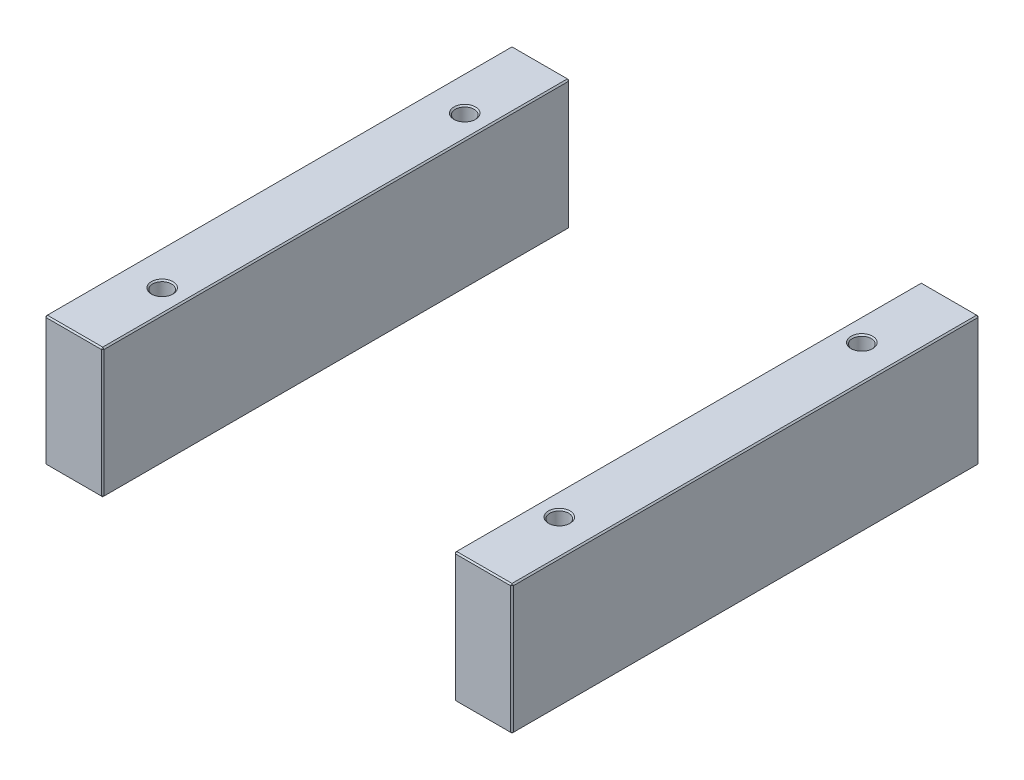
ISO-10303-21;
HEADER;
FILE_DESCRIPTION(('STEP AP214'),'2;1');
FILE_NAME('part.step','',(''),(''),'','','');
FILE_SCHEMA(('AUTOMOTIVE_DESIGN { 1 0 10303 214 1 1 1 1 }'));
ENDSEC;
DATA;
#1=APPLICATION_CONTEXT('core data for automotive mechanical design processes');
#2=APPLICATION_PROTOCOL_DEFINITION('international standard','automotive_design',2000,#1);
#3=PRODUCT_CONTEXT('',#1,'mechanical');
#4=PRODUCT('Part','Part','',(#3));
#5=PRODUCT_RELATED_PRODUCT_CATEGORY('part','',(#4));
#6=PRODUCT_DEFINITION_FORMATION('','',#4);
#7=PRODUCT_DEFINITION_CONTEXT('part definition',#1,'design');
#8=PRODUCT_DEFINITION('design','',#6,#7);
#9=PRODUCT_DEFINITION_SHAPE('','',#8);
#10=(LENGTH_UNIT() NAMED_UNIT(*) SI_UNIT(.MILLI.,.METRE.));
#11=(NAMED_UNIT(*) PLANE_ANGLE_UNIT() SI_UNIT($,.RADIAN.));
#12=(NAMED_UNIT(*) SI_UNIT($,.STERADIAN.) SOLID_ANGLE_UNIT());
#13=UNCERTAINTY_MEASURE_WITH_UNIT(LENGTH_MEASURE(1.E-05),#10,'distance_accuracy_value','');
#14=(GEOMETRIC_REPRESENTATION_CONTEXT(3) GLOBAL_UNCERTAINTY_ASSIGNED_CONTEXT((#13)) GLOBAL_UNIT_ASSIGNED_CONTEXT((#10,
#11,#12)) REPRESENTATION_CONTEXT('',''));
#15=CARTESIAN_POINT('',(0.,0.,0.));
#16=DIRECTION('',(0.,0.,1.));
#17=DIRECTION('',(1.,0.,0.));
#18=AXIS2_PLACEMENT_3D('',#15,#16,#17);
#19=CARTESIAN_POINT('',(-173.,96.,-173.));
#20=DIRECTION('',(0.,0.,1.));
#21=DIRECTION('',(1.,0.,0.));
#22=AXIS2_PLACEMENT_3D('',#19,#20,#21);
#23=PLANE('',#22);
#24=DIRECTION('',(-1.,0.,0.));
#25=VECTOR('',#24,1.);
#26=CARTESIAN_POINT('',(-173.,1.,-173.));
#27=LINE('',#26,#25);
#28=CARTESIAN_POINT('',(-131.,1.,-173.));
#29=VERTEX_POINT('',#28);
#30=CARTESIAN_POINT('',(-172.,1.,-173.));
#31=VERTEX_POINT('',#30);
#32=EDGE_CURVE('P0_E137',#29,#31,#27,.T.);
#33=ORIENTED_EDGE('',*,*,#32,.T.);
#34=DIRECTION('',(0.,1.,0.));
#35=VECTOR('',#34,1.);
#36=CARTESIAN_POINT('',(-172.,96.,-173.));
#37=LINE('',#36,#35);
#38=CARTESIAN_POINT('',(-172.,95.,-173.));
#39=VERTEX_POINT('',#38);
#40=EDGE_CURVE('P0_E235',#31,#39,#37,.T.);
#41=ORIENTED_EDGE('',*,*,#40,.T.);
#42=DIRECTION('',(1.,0.,0.));
#43=VECTOR('',#42,1.);
#44=CARTESIAN_POINT('',(-173.,95.,-173.));
#45=LINE('',#44,#43);
#46=CARTESIAN_POINT('',(-131.,95.,-173.));
#47=VERTEX_POINT('',#46);
#48=EDGE_CURVE('P0_E233',#39,#47,#45,.T.);
#49=ORIENTED_EDGE('',*,*,#48,.T.);
#50=DIRECTION('',(0.,-1.,0.));
#51=VECTOR('',#50,1.);
#52=CARTESIAN_POINT('',(-131.,96.,-173.));
#53=LINE('',#52,#51);
#54=EDGE_CURVE('P0_E230',#47,#29,#53,.T.);
#55=ORIENTED_EDGE('',*,*,#54,.T.);
#56=EDGE_LOOP('',(#33,#41,#49,#55));
#57=FACE_BOUND('',#56,.T.);
#58=ADVANCED_FACE('P0_F16',(#57),#23,.F.);
#59=CARTESIAN_POINT('',(-173.,96.,173.));
#60=DIRECTION('',(1.,0.,0.));
#61=DIRECTION('',(0.,0.,-1.));
#62=AXIS2_PLACEMENT_3D('',#59,#60,#61);
#63=PLANE('',#62);
#64=DIRECTION('',(0.,1.,0.));
#65=VECTOR('',#64,1.);
#66=CARTESIAN_POINT('',(-173.,96.,172.));
#67=LINE('',#66,#65);
#68=CARTESIAN_POINT('',(-173.,1.,172.));
#69=VERTEX_POINT('',#68);
#70=CARTESIAN_POINT('',(-173.,95.,172.));
#71=VERTEX_POINT('',#70);
#72=EDGE_CURVE('P0_E217',#69,#71,#67,.T.);
#73=ORIENTED_EDGE('',*,*,#72,.T.);
#74=DIRECTION('',(0.,0.,-1.));
#75=VECTOR('',#74,1.);
#76=CARTESIAN_POINT('',(-173.,95.,173.));
#77=LINE('',#76,#75);
#78=CARTESIAN_POINT('',(-173.,95.,-172.));
#79=VERTEX_POINT('',#78);
#80=EDGE_CURVE('P0_E228',#71,#79,#77,.T.);
#81=ORIENTED_EDGE('',*,*,#80,.T.);
#82=DIRECTION('',(0.,-1.,0.));
#83=VECTOR('',#82,1.);
#84=CARTESIAN_POINT('',(-173.,96.,-172.));
#85=LINE('',#84,#83);
#86=CARTESIAN_POINT('',(-173.,1.,-172.));
#87=VERTEX_POINT('',#86);
#88=EDGE_CURVE('P0_E225',#79,#87,#85,.T.);
#89=ORIENTED_EDGE('',*,*,#88,.T.);
#90=DIRECTION('',(0.,0.,1.));
#91=VECTOR('',#90,1.);
#92=CARTESIAN_POINT('',(-173.,1.,173.));
#93=LINE('',#92,#91);
#94=EDGE_CURVE('P0_E214',#87,#69,#93,.T.);
#95=ORIENTED_EDGE('',*,*,#94,.T.);
#96=EDGE_LOOP('',(#73,#81,#89,#95));
#97=FACE_BOUND('',#96,.T.);
#98=ADVANCED_FACE('P0_F302',(#97),#63,.F.);
#99=CARTESIAN_POINT('',(-173.,96.,173.));
#100=DIRECTION('',(0.,0.,-1.));
#101=DIRECTION('',(-1.,0.,0.));
#102=AXIS2_PLACEMENT_3D('',#99,#100,#101);
#103=PLANE('',#102);
#104=DIRECTION('',(-1.,0.,0.));
#105=VECTOR('',#104,1.);
#106=CARTESIAN_POINT('',(-173.,95.,173.));
#107=LINE('',#106,#105);
#108=CARTESIAN_POINT('',(-131.,95.,173.));
#109=VERTEX_POINT('',#108);
#110=CARTESIAN_POINT('',(-172.,95.,173.));
#111=VERTEX_POINT('',#110);
#112=EDGE_CURVE('P0_E242',#109,#111,#107,.T.);
#113=ORIENTED_EDGE('',*,*,#112,.T.);
#114=DIRECTION('',(0.,-1.,0.));
#115=VECTOR('',#114,1.);
#116=CARTESIAN_POINT('',(-172.,96.,173.));
#117=LINE('',#116,#115);
#118=CARTESIAN_POINT('',(-172.,1.,173.));
#119=VERTEX_POINT('',#118);
#120=EDGE_CURVE('P0_E244',#111,#119,#117,.T.);
#121=ORIENTED_EDGE('',*,*,#120,.T.);
#122=DIRECTION('',(1.,0.,0.));
#123=VECTOR('',#122,1.);
#124=CARTESIAN_POINT('',(-130.,1.,173.));
#125=LINE('',#124,#123);
#126=CARTESIAN_POINT('',(-131.,1.,173.));
#127=VERTEX_POINT('',#126);
#128=EDGE_CURVE('P0_E240',#119,#127,#125,.T.);
#129=ORIENTED_EDGE('',*,*,#128,.T.);
#130=DIRECTION('',(0.,1.,0.));
#131=VECTOR('',#130,1.);
#132=CARTESIAN_POINT('',(-131.,96.,173.));
#133=LINE('',#132,#131);
#134=EDGE_CURVE('P0_E238',#127,#109,#133,.T.);
#135=ORIENTED_EDGE('',*,*,#134,.T.);
#136=EDGE_LOOP('',(#113,#121,#129,#135));
#137=FACE_BOUND('',#136,.T.);
#138=ADVANCED_FACE('P0_F341',(#137),#103,.F.);
#139=CARTESIAN_POINT('',(-130.,96.,-173.));
#140=DIRECTION('',(-1.,0.,0.));
#141=DIRECTION('',(0.,0.,1.));
#142=AXIS2_PLACEMENT_3D('',#139,#140,#141);
#143=PLANE('',#142);
#144=DIRECTION('',(0.,0.,1.));
#145=VECTOR('',#144,1.);
#146=CARTESIAN_POINT('',(-130.,95.,-173.));
#147=LINE('',#146,#145);
#148=CARTESIAN_POINT('',(-130.,95.,-172.));
#149=VERTEX_POINT('',#148);
#150=CARTESIAN_POINT('',(-130.,95.,172.));
#151=VERTEX_POINT('',#150);
#152=EDGE_CURVE('P0_E31',#149,#151,#147,.T.);
#153=ORIENTED_EDGE('',*,*,#152,.T.);
#154=DIRECTION('',(0.,-1.,0.));
#155=VECTOR('',#154,1.);
#156=CARTESIAN_POINT('',(-130.,96.,172.));
#157=LINE('',#156,#155);
#158=CARTESIAN_POINT('',(-130.,1.,172.));
#159=VERTEX_POINT('',#158);
#160=EDGE_CURVE('P0_E190',#151,#159,#157,.T.);
#161=ORIENTED_EDGE('',*,*,#160,.T.);
#162=DIRECTION('',(0.,0.,-1.));
#163=VECTOR('',#162,1.);
#164=CARTESIAN_POINT('',(-130.,1.,-173.));
#165=LINE('',#164,#163);
#166=CARTESIAN_POINT('',(-130.,1.,-172.));
#167=VERTEX_POINT('',#166);
#168=EDGE_CURVE('P0_E256',#159,#167,#165,.T.);
#169=ORIENTED_EDGE('',*,*,#168,.T.);
#170=DIRECTION('',(0.,1.,0.));
#171=VECTOR('',#170,1.);
#172=CARTESIAN_POINT('',(-130.,96.,-172.));
#173=LINE('',#172,#171);
#174=EDGE_CURVE('P0_E36',#167,#149,#173,.T.);
#175=ORIENTED_EDGE('',*,*,#174,.T.);
#176=EDGE_LOOP('',(#153,#161,#169,#175));
#177=FACE_BOUND('',#176,.T.);
#178=ADVANCED_FACE('P0_F535',(#177),#143,.F.);
#179=CARTESIAN_POINT('',(0.,96.,0.));
#180=DIRECTION('',(0.,-1.,0.));
#181=DIRECTION('',(0.,0.,-1.));
#182=AXIS2_PLACEMENT_3D('',#179,#180,#181);
#183=PLANE('',#182);
#184=CARTESIAN_POINT('',(-147.,96.,112.));
#185=DIRECTION('',(0.,-1.,0.));
#186=DIRECTION('',(0.,0.,-1.));
#187=AXIS2_PLACEMENT_3D('',#184,#185,#186);
#188=CIRCLE('',#187,8.);
#189=CARTESIAN_POINT('',(-147.,96.,104.));
#190=VERTEX_POINT('',#189);
#191=EDGE_CURVE('P0_E24',#190,#190,#188,.T.);
#192=ORIENTED_EDGE('',*,*,#191,.T.);
#193=EDGE_LOOP('',(#192));
#194=FACE_BOUND('',#193,.T.);
#195=CARTESIAN_POINT('',(-147.,96.,-112.));
#196=DIRECTION('',(0.,-1.,0.));
#197=DIRECTION('',(0.,0.,-1.));
#198=AXIS2_PLACEMENT_3D('',#195,#196,#197);
#199=CIRCLE('',#198,8.);
#200=CARTESIAN_POINT('',(-147.,96.,-120.));
#201=VERTEX_POINT('',#200);
#202=EDGE_CURVE('P0_E189',#201,#201,#199,.T.);
#203=ORIENTED_EDGE('',*,*,#202,.T.);
#204=EDGE_LOOP('',(#203));
#205=FACE_BOUND('',#204,.T.);
#206=DIRECTION('',(0.,0.,1.));
#207=VECTOR('',#206,1.);
#208=CARTESIAN_POINT('',(-172.,96.,0.));
#209=LINE('',#208,#207);
#210=CARTESIAN_POINT('',(-172.,96.,-172.));
#211=VERTEX_POINT('',#210);
#212=CARTESIAN_POINT('',(-172.,96.,172.));
#213=VERTEX_POINT('',#212);
#214=EDGE_CURVE('P0_E251',#211,#213,#209,.T.);
#215=ORIENTED_EDGE('',*,*,#214,.T.);
#216=DIRECTION('',(1.,0.,0.));
#217=VECTOR('',#216,1.);
#218=CARTESIAN_POINT('',(1.11022302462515E-13,96.,172.));
#219=LINE('',#218,#217);
#220=CARTESIAN_POINT('',(-131.,96.,172.));
#221=VERTEX_POINT('',#220);
#222=EDGE_CURVE('P0_E253',#213,#221,#219,.T.);
#223=ORIENTED_EDGE('',*,*,#222,.T.);
#224=DIRECTION('',(0.,0.,-1.));
#225=VECTOR('',#224,1.);
#226=CARTESIAN_POINT('',(-131.,96.,0.));
#227=LINE('',#226,#225);
#228=CARTESIAN_POINT('',(-131.,96.,-172.));
#229=VERTEX_POINT('',#228);
#230=EDGE_CURVE('P0_E247',#221,#229,#227,.T.);
#231=ORIENTED_EDGE('',*,*,#230,.T.);
#232=DIRECTION('',(-1.,0.,0.));
#233=VECTOR('',#232,1.);
#234=CARTESIAN_POINT('',(-1.11022302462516E-13,96.,-172.));
#235=LINE('',#234,#233);
#236=EDGE_CURVE('P0_E249',#229,#211,#235,.T.);
#237=ORIENTED_EDGE('',*,*,#236,.T.);
#238=EDGE_LOOP('',(#215,#223,#231,#237));
#239=FACE_BOUND('',#238,.T.);
#240=ADVANCED_FACE('P0_F195',(#194,#205,#239),#183,.F.);
#241=CARTESIAN_POINT('',(0.,0.,0.));
#242=DIRECTION('',(0.,-1.,0.));
#243=DIRECTION('',(0.,0.,-1.));
#244=AXIS2_PLACEMENT_3D('',#241,#242,#243);
#245=PLANE('',#244);
#246=CARTESIAN_POINT('',(-147.,0.,-112.));
#247=DIRECTION('',(0.,-1.,0.));
#248=DIRECTION('',(0.,0.,-1.));
#249=AXIS2_PLACEMENT_3D('',#246,#247,#248);
#250=CIRCLE('',#249,8.);
#251=CARTESIAN_POINT('',(-147.,0.,-120.));
#252=VERTEX_POINT('',#251);
#253=EDGE_CURVE('P0_E220',#252,#252,#250,.F.);
#254=ORIENTED_EDGE('',*,*,#253,.T.);
#255=EDGE_LOOP('',(#254));
#256=FACE_BOUND('',#255,.T.);
#257=CARTESIAN_POINT('',(-147.,0.,112.));
#258=DIRECTION('',(0.,-1.,0.));
#259=DIRECTION('',(0.,0.,-1.));
#260=AXIS2_PLACEMENT_3D('',#257,#258,#259);
#261=CIRCLE('',#260,8.);
#262=CARTESIAN_POINT('',(-147.,0.,104.));
#263=VERTEX_POINT('',#262);
#264=EDGE_CURVE('P0_E608',#263,#263,#261,.F.);
#265=ORIENTED_EDGE('',*,*,#264,.T.);
#266=EDGE_LOOP('',(#265));
#267=FACE_BOUND('',#266,.T.);
#268=DIRECTION('',(-1.,0.,0.));
#269=VECTOR('',#268,1.);
#270=CARTESIAN_POINT('',(-173.,0.,172.));
#271=LINE('',#270,#269);
#272=CARTESIAN_POINT('',(-131.,0.,172.));
#273=VERTEX_POINT('',#272);
#274=CARTESIAN_POINT('',(-172.,0.,172.));
#275=VERTEX_POINT('',#274);
#276=EDGE_CURVE('P0_E114',#273,#275,#271,.T.);
#277=ORIENTED_EDGE('',*,*,#276,.T.);
#278=DIRECTION('',(0.,0.,-1.));
#279=VECTOR('',#278,1.);
#280=CARTESIAN_POINT('',(-172.,0.,-173.));
#281=LINE('',#280,#279);
#282=CARTESIAN_POINT('',(-172.,0.,-172.));
#283=VERTEX_POINT('',#282);
#284=EDGE_CURVE('P0_E110',#275,#283,#281,.T.);
#285=ORIENTED_EDGE('',*,*,#284,.T.);
#286=DIRECTION('',(1.,0.,0.));
#287=VECTOR('',#286,1.);
#288=CARTESIAN_POINT('',(-130.,0.,-172.));
#289=LINE('',#288,#287);
#290=CARTESIAN_POINT('',(-131.,0.,-172.));
#291=VERTEX_POINT('',#290);
#292=EDGE_CURVE('P0_E104',#283,#291,#289,.T.);
#293=ORIENTED_EDGE('',*,*,#292,.T.);
#294=DIRECTION('',(0.,0.,1.));
#295=VECTOR('',#294,1.);
#296=CARTESIAN_POINT('',(-131.,0.,173.));
#297=LINE('',#296,#295);
#298=EDGE_CURVE('P0_E107',#291,#273,#297,.T.);
#299=ORIENTED_EDGE('',*,*,#298,.T.);
#300=EDGE_LOOP('',(#277,#285,#293,#299));
#301=FACE_BOUND('',#300,.T.);
#302=ADVANCED_FACE('P0_F106',(#256,#267,#301),#245,.T.);
#303=CARTESIAN_POINT('',(-147.,0.,-112.));
#304=DIRECTION('',(0.,1.,0.));
#305=DIRECTION('',(0.,0.,1.));
#306=AXIS2_PLACEMENT_3D('',#303,#304,#305);
#307=CYLINDRICAL_SURFACE('',#306,7.);
#308=CARTESIAN_POINT('',(-147.,95.,-112.));
#309=DIRECTION('',(0.,-1.,0.));
#310=DIRECTION('',(0.,0.,-1.));
#311=AXIS2_PLACEMENT_3D('',#308,#309,#310);
#312=CIRCLE('',#311,7.);
#313=CARTESIAN_POINT('',(-147.,95.,-119.));
#314=VERTEX_POINT('',#313);
#315=EDGE_CURVE('P0_E10',#314,#314,#312,.F.);
#316=ORIENTED_EDGE('',*,*,#315,.T.);
#317=EDGE_LOOP('',(#316));
#318=FACE_BOUND('',#317,.T.);
#319=CARTESIAN_POINT('',(-147.,1.00000000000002,-112.));
#320=DIRECTION('',(0.,-1.,0.));
#321=DIRECTION('',(0.,0.,-1.));
#322=AXIS2_PLACEMENT_3D('',#319,#320,#321);
#323=CIRCLE('',#322,7.);
#324=CARTESIAN_POINT('',(-147.,1.00000000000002,-119.));
#325=VERTEX_POINT('',#324);
#326=EDGE_CURVE('P0_E215',#325,#325,#323,.T.);
#327=ORIENTED_EDGE('',*,*,#326,.T.);
#328=EDGE_LOOP('',(#327));
#329=FACE_BOUND('',#328,.T.);
#330=ADVANCED_FACE('P0_F208',(#318,#329),#307,.F.);
#331=CARTESIAN_POINT('',(-147.,0.,112.));
#332=DIRECTION('',(0.,1.,0.));
#333=DIRECTION('',(0.,0.,1.));
#334=AXIS2_PLACEMENT_3D('',#331,#332,#333);
#335=CYLINDRICAL_SURFACE('',#334,7.);
#336=CARTESIAN_POINT('',(-147.,95.,112.));
#337=DIRECTION('',(0.,-1.,0.));
#338=DIRECTION('',(0.,0.,-1.));
#339=AXIS2_PLACEMENT_3D('',#336,#337,#338);
#340=CIRCLE('',#339,7.);
#341=CARTESIAN_POINT('',(-147.,95.,105.));
#342=VERTEX_POINT('',#341);
#343=EDGE_CURVE('P0_E186',#342,#342,#340,.F.);
#344=ORIENTED_EDGE('',*,*,#343,.T.);
#345=EDGE_LOOP('',(#344));
#346=FACE_BOUND('',#345,.T.);
#347=CARTESIAN_POINT('',(-147.,1.00000000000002,112.));
#348=DIRECTION('',(0.,-1.,0.));
#349=DIRECTION('',(0.,0.,-1.));
#350=AXIS2_PLACEMENT_3D('',#347,#348,#349);
#351=CIRCLE('',#350,7.);
#352=CARTESIAN_POINT('',(-147.,1.00000000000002,105.));
#353=VERTEX_POINT('',#352);
#354=EDGE_CURVE('P0_E212',#353,#353,#351,.T.);
#355=ORIENTED_EDGE('',*,*,#354,.T.);
#356=EDGE_LOOP('',(#355));
#357=FACE_BOUND('',#356,.T.);
#358=ADVANCED_FACE('P0_F204',(#346,#357),#335,.F.);
#359=CARTESIAN_POINT('',(-147.,0.,-112.));
#360=DIRECTION('',(0.,-1.,0.));
#361=DIRECTION('',(0.,0.,-1.));
#362=AXIS2_PLACEMENT_3D('',#359,#360,#361);
#363=CONICAL_SURFACE('',#362,8.,0.78539816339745);
#364=ORIENTED_EDGE('',*,*,#326,.F.);
#365=EDGE_LOOP('',(#364));
#366=FACE_BOUND('',#365,.T.);
#367=ORIENTED_EDGE('',*,*,#253,.F.);
#368=EDGE_LOOP('',(#367));
#369=FACE_BOUND('',#368,.T.);
#370=ADVANCED_FACE('P0_F207',(#366,#369),#363,.F.);
#371=CARTESIAN_POINT('',(-147.,0.,112.));
#372=DIRECTION('',(0.,-1.,0.));
#373=DIRECTION('',(0.,0.,-1.));
#374=AXIS2_PLACEMENT_3D('',#371,#372,#373);
#375=CONICAL_SURFACE('',#374,8.,0.78539816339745);
#376=ORIENTED_EDGE('',*,*,#354,.F.);
#377=EDGE_LOOP('',(#376));
#378=FACE_BOUND('',#377,.T.);
#379=ORIENTED_EDGE('',*,*,#264,.F.);
#380=EDGE_LOOP('',(#379));
#381=FACE_BOUND('',#380,.T.);
#382=ADVANCED_FACE('P0_F347',(#378,#381),#375,.F.);
#383=CARTESIAN_POINT('',(-130.,96.,172.));
#384=DIRECTION('',(-0.707106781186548,0.,-0.707106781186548));
#385=DIRECTION('',(0.,-1.,0.));
#386=AXIS2_PLACEMENT_3D('',#383,#384,#385);
#387=PLANE('',#386);
#388=DIRECTION('',(-0.707106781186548,0.,0.707106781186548));
#389=VECTOR('',#388,1.);
#390=CARTESIAN_POINT('',(-130.5,95.,172.5));
#391=LINE('',#390,#389);
#392=EDGE_CURVE('P0_E125',#109,#151,#391,.F.);
#393=ORIENTED_EDGE('',*,*,#392,.F.);
#394=ORIENTED_EDGE('',*,*,#134,.F.);
#395=DIRECTION('',(0.707106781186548,0.,-0.707106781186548));
#396=VECTOR('',#395,1.);
#397=CARTESIAN_POINT('',(-131.,1.,173.));
#398=LINE('',#397,#396);
#399=EDGE_CURVE('P0_E181',#159,#127,#398,.F.);
#400=ORIENTED_EDGE('',*,*,#399,.F.);
#401=ORIENTED_EDGE('',*,*,#160,.F.);
#402=EDGE_LOOP('',(#393,#394,#400,#401));
#403=FACE_BOUND('',#402,.T.);
#404=ADVANCED_FACE('P0_F351',(#403),#387,.F.);
#405=CARTESIAN_POINT('',(-131.,96.,172.));
#406=DIRECTION('',(0.57735026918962,0.577350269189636,0.57735026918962));
#407=DIRECTION('',(0.,-0.707106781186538,0.707106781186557));
#408=AXIS2_PLACEMENT_3D('',#405,#406,#407);
#409=PLANE('',#408);
#410=DIRECTION('',(0.,0.707106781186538,-0.707106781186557));
#411=VECTOR('',#410,1.);
#412=CARTESIAN_POINT('',(-131.,96.,172.));
#413=LINE('',#412,#411);
#414=EDGE_CURVE('P0_E175',#109,#221,#413,.T.);
#415=ORIENTED_EDGE('',*,*,#414,.F.);
#416=ORIENTED_EDGE('',*,*,#392,.T.);
#417=DIRECTION('',(0.707106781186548,-0.707106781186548,0.));
#418=VECTOR('',#417,1.);
#419=CARTESIAN_POINT('',(-131.,96.,172.));
#420=LINE('',#419,#418);
#421=EDGE_CURVE('P0_E178',#221,#151,#420,.T.);
#422=ORIENTED_EDGE('',*,*,#421,.F.);
#423=EDGE_LOOP('',(#415,#416,#422));
#424=FACE_BOUND('',#423,.T.);
#425=ADVANCED_FACE('P0_F487',(#424),#409,.T.);
#426=CARTESIAN_POINT('',(-131.,1.,173.));
#427=DIRECTION('',(0.57735026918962,-0.577350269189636,0.57735026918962));
#428=DIRECTION('',(0.,-0.707106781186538,-0.707106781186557));
#429=AXIS2_PLACEMENT_3D('',#426,#427,#428);
#430=PLANE('',#429);
#431=DIRECTION('',(0.707106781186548,0.707106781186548,0.));
#432=VECTOR('',#431,1.);
#433=CARTESIAN_POINT('',(-130.5,0.500000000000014,172.));
#434=LINE('',#433,#432);
#435=EDGE_CURVE('P0_E123',#159,#273,#434,.F.);
#436=ORIENTED_EDGE('',*,*,#435,.F.);
#437=ORIENTED_EDGE('',*,*,#399,.T.);
#438=DIRECTION('',(0.,-0.707106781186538,-0.707106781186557));
#439=VECTOR('',#438,1.);
#440=CARTESIAN_POINT('',(-131.,1.,173.));
#441=LINE('',#440,#439);
#442=EDGE_CURVE('P0_E172',#273,#127,#441,.F.);
#443=ORIENTED_EDGE('',*,*,#442,.F.);
#444=EDGE_LOOP('',(#436,#437,#443));
#445=FACE_BOUND('',#444,.T.);
#446=ADVANCED_FACE('P0_F478',(#445),#430,.T.);
#447=CARTESIAN_POINT('',(-131.,96.,0.));
#448=DIRECTION('',(-0.707106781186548,-0.707106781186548,0.));
#449=DIRECTION('',(0.,0.,-1.));
#450=AXIS2_PLACEMENT_3D('',#447,#448,#449);
#451=PLANE('',#450);
#452=ORIENTED_EDGE('',*,*,#421,.T.);
#453=ORIENTED_EDGE('',*,*,#152,.F.);
#454=DIRECTION('',(-0.707106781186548,0.707106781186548,0.));
#455=VECTOR('',#454,1.);
#456=CARTESIAN_POINT('',(-130.5,95.5,-172.));
#457=LINE('',#456,#455);
#458=EDGE_CURVE('P0_E165',#229,#149,#457,.F.);
#459=ORIENTED_EDGE('',*,*,#458,.F.);
#460=ORIENTED_EDGE('',*,*,#230,.F.);
#461=EDGE_LOOP('',(#452,#453,#459,#460));
#462=FACE_BOUND('',#461,.T.);
#463=ADVANCED_FACE('P0_F318',(#462),#451,.F.);
#464=CARTESIAN_POINT('',(1.11022302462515E-13,96.,172.));
#465=DIRECTION('',(0.,-0.707106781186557,-0.707106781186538));
#466=DIRECTION('',(1.,0.,0.));
#467=AXIS2_PLACEMENT_3D('',#464,#465,#466);
#468=PLANE('',#467);
#469=ORIENTED_EDGE('',*,*,#414,.T.);
#470=ORIENTED_EDGE('',*,*,#222,.F.);
#471=DIRECTION('',(0.,-0.707106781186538,0.707106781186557));
#472=VECTOR('',#471,1.);
#473=CARTESIAN_POINT('',(-172.,95.5,172.5));
#474=LINE('',#473,#472);
#475=EDGE_CURVE('P0_E162',#111,#213,#474,.F.);
#476=ORIENTED_EDGE('',*,*,#475,.F.);
#477=ORIENTED_EDGE('',*,*,#112,.F.);
#478=EDGE_LOOP('',(#469,#470,#476,#477));
#479=FACE_BOUND('',#478,.T.);
#480=ADVANCED_FACE('P0_F313',(#479),#468,.F.);
#481=CARTESIAN_POINT('',(-172.,96.,173.));
#482=DIRECTION('',(0.707106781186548,0.,-0.707106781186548));
#483=DIRECTION('',(0.,-1.,0.));
#484=AXIS2_PLACEMENT_3D('',#481,#482,#483);
#485=PLANE('',#484);
#486=DIRECTION('',(0.707106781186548,0.,0.707106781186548));
#487=VECTOR('',#486,1.);
#488=CARTESIAN_POINT('',(-172.,1.,173.));
#489=LINE('',#488,#487);
#490=EDGE_CURVE('P0_E156',#119,#69,#489,.F.);
#491=ORIENTED_EDGE('',*,*,#490,.F.);
#492=ORIENTED_EDGE('',*,*,#120,.F.);
#493=DIRECTION('',(-0.707106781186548,0.,-0.707106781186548));
#494=VECTOR('',#493,1.);
#495=CARTESIAN_POINT('',(-173.,95.,172.));
#496=LINE('',#495,#494);
#497=EDGE_CURVE('P0_E159',#71,#111,#496,.F.);
#498=ORIENTED_EDGE('',*,*,#497,.F.);
#499=ORIENTED_EDGE('',*,*,#72,.F.);
#500=EDGE_LOOP('',(#491,#492,#498,#499));
#501=FACE_BOUND('',#500,.T.);
#502=ADVANCED_FACE('P0_F307',(#501),#485,.F.);
#503=CARTESIAN_POINT('',(-173.,1.,173.));
#504=DIRECTION('',(0.,-0.707106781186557,0.707106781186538));
#505=DIRECTION('',(-1.,0.,0.));
#506=AXIS2_PLACEMENT_3D('',#503,#504,#505);
#507=PLANE('',#506);
#508=ORIENTED_EDGE('',*,*,#442,.T.);
#509=ORIENTED_EDGE('',*,*,#128,.F.);
#510=DIRECTION('',(0.,0.707106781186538,0.707106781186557));
#511=VECTOR('',#510,1.);
#512=CARTESIAN_POINT('',(-172.,1.,173.));
#513=LINE('',#512,#511);
#514=EDGE_CURVE('P0_E134',#275,#119,#513,.T.);
#515=ORIENTED_EDGE('',*,*,#514,.F.);
#516=ORIENTED_EDGE('',*,*,#276,.F.);
#517=EDGE_LOOP('',(#508,#509,#515,#516));
#518=FACE_BOUND('',#517,.T.);
#519=ADVANCED_FACE('P0_F333',(#518),#507,.T.);
#520=CARTESIAN_POINT('',(-130.,1.,-173.));
#521=DIRECTION('',(0.707106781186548,-0.707106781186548,0.));
#522=DIRECTION('',(0.,0.,1.));
#523=AXIS2_PLACEMENT_3D('',#520,#521,#522);
#524=PLANE('',#523);
#525=ORIENTED_EDGE('',*,*,#435,.T.);
#526=ORIENTED_EDGE('',*,*,#298,.F.);
#527=DIRECTION('',(-0.707106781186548,-0.707106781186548,0.));
#528=VECTOR('',#527,1.);
#529=CARTESIAN_POINT('',(-131.,0.,-172.));
#530=LINE('',#529,#528);
#531=EDGE_CURVE('P0_E120',#167,#291,#530,.T.);
#532=ORIENTED_EDGE('',*,*,#531,.F.);
#533=ORIENTED_EDGE('',*,*,#168,.F.);
#534=EDGE_LOOP('',(#525,#526,#532,#533));
#535=FACE_BOUND('',#534,.T.);
#536=ADVANCED_FACE('P0_F119',(#535),#524,.T.);
#537=CARTESIAN_POINT('',(-131.,96.,-173.));
#538=DIRECTION('',(-0.707106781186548,0.,0.707106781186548));
#539=DIRECTION('',(0.,-1.,0.));
#540=AXIS2_PLACEMENT_3D('',#537,#538,#539);
#541=PLANE('',#540);
#542=DIRECTION('',(0.707106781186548,0.,0.707106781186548));
#543=VECTOR('',#542,1.);
#544=CARTESIAN_POINT('',(-131.,95.,-173.));
#545=LINE('',#544,#543);
#546=EDGE_CURVE('P0_E168',#149,#47,#545,.F.);
#547=ORIENTED_EDGE('',*,*,#546,.F.);
#548=ORIENTED_EDGE('',*,*,#174,.F.);
#549=DIRECTION('',(-0.707106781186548,0.,-0.707106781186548));
#550=VECTOR('',#549,1.);
#551=CARTESIAN_POINT('',(-130.5,1.,-172.5));
#552=LINE('',#551,#550);
#553=EDGE_CURVE('P0_E133',#29,#167,#552,.F.);
#554=ORIENTED_EDGE('',*,*,#553,.F.);
#555=ORIENTED_EDGE('',*,*,#54,.F.);
#556=EDGE_LOOP('',(#547,#548,#554,#555));
#557=FACE_BOUND('',#556,.T.);
#558=ADVANCED_FACE('P0_F323',(#557),#541,.F.);
#559=CARTESIAN_POINT('',(-131.,95.,-173.));
#560=DIRECTION('',(0.57735026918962,0.577350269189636,-0.57735026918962));
#561=DIRECTION('',(0.,0.707106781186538,0.707106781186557));
#562=AXIS2_PLACEMENT_3D('',#559,#560,#561);
#563=PLANE('',#562);
#564=ORIENTED_EDGE('',*,*,#458,.T.);
#565=ORIENTED_EDGE('',*,*,#546,.T.);
#566=DIRECTION('',(0.,-0.707106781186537,-0.707106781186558));
#567=VECTOR('',#566,1.);
#568=CARTESIAN_POINT('',(-131.,95.,-173.));
#569=LINE('',#568,#567);
#570=EDGE_CURVE('P0_E151',#229,#47,#569,.T.);
#571=ORIENTED_EDGE('',*,*,#570,.F.);
#572=EDGE_LOOP('',(#564,#565,#571));
#573=FACE_BOUND('',#572,.T.);
#574=ADVANCED_FACE('P0_F321',(#573),#563,.T.);
#575=CARTESIAN_POINT('',(-173.,95.,172.));
#576=DIRECTION('',(-0.57735026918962,0.577350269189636,0.57735026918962));
#577=DIRECTION('',(0.,-0.707106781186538,0.707106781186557));
#578=AXIS2_PLACEMENT_3D('',#575,#576,#577);
#579=PLANE('',#578);
#580=ORIENTED_EDGE('',*,*,#497,.T.);
#581=ORIENTED_EDGE('',*,*,#475,.T.);
#582=DIRECTION('',(0.707106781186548,0.707106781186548,0.));
#583=VECTOR('',#582,1.);
#584=CARTESIAN_POINT('',(-173.,95.,172.));
#585=LINE('',#584,#583);
#586=EDGE_CURVE('P0_E142',#71,#213,#585,.T.);
#587=ORIENTED_EDGE('',*,*,#586,.F.);
#588=EDGE_LOOP('',(#580,#581,#587));
#589=FACE_BOUND('',#588,.T.);
#590=ADVANCED_FACE('P0_F310',(#589),#579,.T.);
#591=CARTESIAN_POINT('',(-172.,1.,173.));
#592=DIRECTION('',(-0.57735026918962,-0.577350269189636,0.57735026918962));
#593=DIRECTION('',(0.,-0.707106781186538,-0.707106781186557));
#594=AXIS2_PLACEMENT_3D('',#591,#592,#593);
#595=PLANE('',#594);
#596=ORIENTED_EDGE('',*,*,#514,.T.);
#597=ORIENTED_EDGE('',*,*,#490,.T.);
#598=DIRECTION('',(0.707106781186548,-0.707106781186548,0.));
#599=VECTOR('',#598,1.);
#600=CARTESIAN_POINT('',(-172.5,0.500000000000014,172.));
#601=LINE('',#600,#599);
#602=EDGE_CURVE('P0_E138',#275,#69,#601,.F.);
#603=ORIENTED_EDGE('',*,*,#602,.F.);
#604=EDGE_LOOP('',(#596,#597,#603));
#605=FACE_BOUND('',#604,.T.);
#606=ADVANCED_FACE('P0_F368',(#605),#595,.T.);
#607=CARTESIAN_POINT('',(-131.,0.,-172.));
#608=DIRECTION('',(0.57735026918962,-0.577350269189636,-0.57735026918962));
#609=DIRECTION('',(0.,0.707106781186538,-0.707106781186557));
#610=AXIS2_PLACEMENT_3D('',#607,#608,#609);
#611=PLANE('',#610);
#612=ORIENTED_EDGE('',*,*,#553,.T.);
#613=ORIENTED_EDGE('',*,*,#531,.T.);
#614=DIRECTION('',(0.,0.707106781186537,-0.707106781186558));
#615=VECTOR('',#614,1.);
#616=CARTESIAN_POINT('',(-131.,0.,-172.));
#617=LINE('',#616,#615);
#618=EDGE_CURVE('P0_E130',#29,#291,#617,.F.);
#619=ORIENTED_EDGE('',*,*,#618,.F.);
#620=EDGE_LOOP('',(#612,#613,#619));
#621=FACE_BOUND('',#620,.T.);
#622=ADVANCED_FACE('P0_F129',(#621),#611,.T.);
#623=CARTESIAN_POINT('',(-1.11022302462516E-13,96.,-172.));
#624=DIRECTION('',(0.,-0.707106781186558,0.707106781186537));
#625=DIRECTION('',(-1.,0.,0.));
#626=AXIS2_PLACEMENT_3D('',#623,#624,#625);
#627=PLANE('',#626);
#628=ORIENTED_EDGE('',*,*,#570,.T.);
#629=ORIENTED_EDGE('',*,*,#48,.F.);
#630=DIRECTION('',(0.,0.707106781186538,0.707106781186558));
#631=VECTOR('',#630,1.);
#632=CARTESIAN_POINT('',(-172.,95.,-173.));
#633=LINE('',#632,#631);
#634=EDGE_CURVE('P0_E139',#211,#39,#633,.F.);
#635=ORIENTED_EDGE('',*,*,#634,.F.);
#636=ORIENTED_EDGE('',*,*,#236,.F.);
#637=EDGE_LOOP('',(#628,#629,#635,#636));
#638=FACE_BOUND('',#637,.T.);
#639=ADVANCED_FACE('P0_F286',(#638),#627,.F.);
#640=CARTESIAN_POINT('',(-172.,96.,0.));
#641=DIRECTION('',(0.707106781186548,-0.707106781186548,0.));
#642=DIRECTION('',(0.,0.,1.));
#643=AXIS2_PLACEMENT_3D('',#640,#641,#642);
#644=PLANE('',#643);
#645=ORIENTED_EDGE('',*,*,#586,.T.);
#646=ORIENTED_EDGE('',*,*,#214,.F.);
#647=DIRECTION('',(-0.707106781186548,-0.707106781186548,0.));
#648=VECTOR('',#647,1.);
#649=CARTESIAN_POINT('',(-172.5,95.5,-172.));
#650=LINE('',#649,#648);
#651=EDGE_CURVE('P0_E145',#79,#211,#650,.F.);
#652=ORIENTED_EDGE('',*,*,#651,.F.);
#653=ORIENTED_EDGE('',*,*,#80,.F.);
#654=EDGE_LOOP('',(#645,#646,#652,#653));
#655=FACE_BOUND('',#654,.T.);
#656=ADVANCED_FACE('P0_F280',(#655),#644,.F.);
#657=CARTESIAN_POINT('',(-173.,1.,173.));
#658=DIRECTION('',(-0.707106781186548,-0.707106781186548,0.));
#659=DIRECTION('',(0.,0.,-1.));
#660=AXIS2_PLACEMENT_3D('',#657,#658,#659);
#661=PLANE('',#660);
#662=ORIENTED_EDGE('',*,*,#602,.T.);
#663=ORIENTED_EDGE('',*,*,#94,.F.);
#664=DIRECTION('',(-0.707106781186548,0.707106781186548,0.));
#665=VECTOR('',#664,1.);
#666=CARTESIAN_POINT('',(-173.,1.,-172.));
#667=LINE('',#666,#665);
#668=EDGE_CURVE('P0_E267',#283,#87,#667,.T.);
#669=ORIENTED_EDGE('',*,*,#668,.F.);
#670=ORIENTED_EDGE('',*,*,#284,.F.);
#671=EDGE_LOOP('',(#662,#663,#669,#670));
#672=FACE_BOUND('',#671,.T.);
#673=ADVANCED_FACE('P0_F298',(#672),#661,.T.);
#674=CARTESIAN_POINT('',(-173.,1.,-173.));
#675=DIRECTION('',(0.,-0.707106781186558,-0.707106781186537));
#676=DIRECTION('',(1.,0.,0.));
#677=AXIS2_PLACEMENT_3D('',#674,#675,#676);
#678=PLANE('',#677);
#679=ORIENTED_EDGE('',*,*,#618,.T.);
#680=ORIENTED_EDGE('',*,*,#292,.F.);
#681=DIRECTION('',(0.,-0.707106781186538,0.707106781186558));
#682=VECTOR('',#681,1.);
#683=CARTESIAN_POINT('',(-172.,0.5,-172.5));
#684=LINE('',#683,#682);
#685=EDGE_CURVE('P0_E265',#31,#283,#684,.T.);
#686=ORIENTED_EDGE('',*,*,#685,.F.);
#687=ORIENTED_EDGE('',*,*,#32,.F.);
#688=EDGE_LOOP('',(#679,#680,#686,#687));
#689=FACE_BOUND('',#688,.T.);
#690=ADVANCED_FACE('P0_F136',(#689),#678,.T.);
#691=CARTESIAN_POINT('',(-172.,95.,-173.));
#692=DIRECTION('',(-0.57735026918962,0.577350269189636,-0.57735026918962));
#693=DIRECTION('',(0.,0.707106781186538,0.707106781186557));
#694=AXIS2_PLACEMENT_3D('',#691,#692,#693);
#695=PLANE('',#694);
#696=ORIENTED_EDGE('',*,*,#651,.T.);
#697=ORIENTED_EDGE('',*,*,#634,.T.);
#698=DIRECTION('',(0.707106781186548,0.,-0.707106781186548));
#699=VECTOR('',#698,1.);
#700=CARTESIAN_POINT('',(-172.,95.,-173.));
#701=LINE('',#700,#699);
#702=EDGE_CURVE('P0_E263',#79,#39,#701,.T.);
#703=ORIENTED_EDGE('',*,*,#702,.F.);
#704=EDGE_LOOP('',(#696,#697,#703));
#705=FACE_BOUND('',#704,.T.);
#706=ADVANCED_FACE('P0_F273',(#705),#695,.T.);
#707=CARTESIAN_POINT('',(-173.,1.,-172.));
#708=DIRECTION('',(-0.57735026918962,-0.577350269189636,-0.57735026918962));
#709=DIRECTION('',(0.,0.707106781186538,-0.707106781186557));
#710=AXIS2_PLACEMENT_3D('',#707,#708,#709);
#711=PLANE('',#710);
#712=ORIENTED_EDGE('',*,*,#685,.T.);
#713=ORIENTED_EDGE('',*,*,#668,.T.);
#714=DIRECTION('',(-0.707106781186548,0.,0.707106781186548));
#715=VECTOR('',#714,1.);
#716=CARTESIAN_POINT('',(-173.,1.,-172.));
#717=LINE('',#716,#715);
#718=EDGE_CURVE('P0_E261',#31,#87,#717,.T.);
#719=ORIENTED_EDGE('',*,*,#718,.F.);
#720=EDGE_LOOP('',(#712,#713,#719));
#721=FACE_BOUND('',#720,.T.);
#722=ADVANCED_FACE('P0_F294',(#721),#711,.T.);
#723=CARTESIAN_POINT('',(-173.,96.,-172.));
#724=DIRECTION('',(0.707106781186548,0.,0.707106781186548));
#725=DIRECTION('',(0.,-1.,0.));
#726=AXIS2_PLACEMENT_3D('',#723,#724,#725);
#727=PLANE('',#726);
#728=ORIENTED_EDGE('',*,*,#702,.T.);
#729=ORIENTED_EDGE('',*,*,#40,.F.);
#730=ORIENTED_EDGE('',*,*,#718,.T.);
#731=ORIENTED_EDGE('',*,*,#88,.F.);
#732=EDGE_LOOP('',(#728,#729,#730,#731));
#733=FACE_BOUND('',#732,.T.);
#734=ADVANCED_FACE('P0_F201',(#733),#727,.F.);
#735=CARTESIAN_POINT('',(-147.,95.,112.));
#736=DIRECTION('',(0.,1.,0.));
#737=DIRECTION('',(0.,0.,1.));
#738=AXIS2_PLACEMENT_3D('',#735,#736,#737);
#739=CONICAL_SURFACE('',#738,7.,0.785398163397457);
#740=ORIENTED_EDGE('',*,*,#191,.F.);
#741=EDGE_LOOP('',(#740));
#742=FACE_BOUND('',#741,.T.);
#743=ORIENTED_EDGE('',*,*,#343,.F.);
#744=EDGE_LOOP('',(#743));
#745=FACE_BOUND('',#744,.T.);
#746=ADVANCED_FACE('P0_F198',(#742,#745),#739,.F.);
#747=CARTESIAN_POINT('',(-147.,95.,-112.));
#748=DIRECTION('',(0.,1.,0.));
#749=DIRECTION('',(0.,0.,1.));
#750=AXIS2_PLACEMENT_3D('',#747,#748,#749);
#751=CONICAL_SURFACE('',#750,7.,0.785398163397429);
#752=ORIENTED_EDGE('',*,*,#202,.F.);
#753=EDGE_LOOP('',(#752));
#754=FACE_BOUND('',#753,.T.);
#755=ORIENTED_EDGE('',*,*,#315,.F.);
#756=EDGE_LOOP('',(#755));
#757=FACE_BOUND('',#756,.T.);
#758=ADVANCED_FACE('P0_F18',(#754,#757),#751,.F.);
#759=CLOSED_SHELL('',(#58,#98,#138,#178,#240,#302,#330,#358,#370,#382,#404,#425,#446,#463,#480,
#502,#519,#536,#558,#574,#590,#606,#622,#639,#656,#673,#690,#706,#722,#734,#746,#758));
#760=MANIFOLD_SOLID_BREP('P0_B1',#759);
#761=CARTESIAN_POINT('',(173.,96.,173.));
#762=DIRECTION('',(0.,0.,-1.));
#763=DIRECTION('',(-1.,0.,0.));
#764=AXIS2_PLACEMENT_3D('',#761,#762,#763);
#765=PLANE('',#764);
#766=DIRECTION('',(0.,-1.,0.));
#767=VECTOR('',#766,1.);
#768=CARTESIAN_POINT('',(131.,96.,173.));
#769=LINE('',#768,#767);
#770=CARTESIAN_POINT('',(131.,95.,173.));
#771=VERTEX_POINT('',#770);
#772=CARTESIAN_POINT('',(131.,1.,173.));
#773=VERTEX_POINT('',#772);
#774=EDGE_CURVE('P1_E173',#771,#773,#769,.T.);
#775=ORIENTED_EDGE('',*,*,#774,.T.);
#776=DIRECTION('',(1.,0.,0.));
#777=VECTOR('',#776,1.);
#778=CARTESIAN_POINT('',(173.,1.,173.));
#779=LINE('',#778,#777);
#780=CARTESIAN_POINT('',(172.,1.,173.));
#781=VERTEX_POINT('',#780);
#782=EDGE_CURVE('P1_E175',#773,#781,#779,.T.);
#783=ORIENTED_EDGE('',*,*,#782,.T.);
#784=DIRECTION('',(0.,1.,0.));
#785=VECTOR('',#784,1.);
#786=CARTESIAN_POINT('',(172.,96.,173.));
#787=LINE('',#786,#785);
#788=CARTESIAN_POINT('',(172.,95.,173.));
#789=VERTEX_POINT('',#788);
#790=EDGE_CURVE('P1_E171',#781,#789,#787,.T.);
#791=ORIENTED_EDGE('',*,*,#790,.T.);
#792=DIRECTION('',(-1.,0.,0.));
#793=VECTOR('',#792,1.);
#794=CARTESIAN_POINT('',(130.,95.,173.));
#795=LINE('',#794,#793);
#796=EDGE_CURVE('P1_E169',#789,#771,#795,.T.);
#797=ORIENTED_EDGE('',*,*,#796,.T.);
#798=EDGE_LOOP('',(#775,#783,#791,#797));
#799=FACE_BOUND('',#798,.T.);
#800=ADVANCED_FACE('P1_F16',(#799),#765,.F.);
#801=CARTESIAN_POINT('',(173.,96.,173.));
#802=DIRECTION('',(-1.,0.,0.));
#803=DIRECTION('',(0.,0.,1.));
#804=AXIS2_PLACEMENT_3D('',#801,#802,#803);
#805=PLANE('',#804);
#806=DIRECTION('',(0.,0.,1.));
#807=VECTOR('',#806,1.);
#808=CARTESIAN_POINT('',(173.,95.,173.));
#809=LINE('',#808,#807);
#810=CARTESIAN_POINT('',(173.,95.,-172.));
#811=VERTEX_POINT('',#810);
#812=CARTESIAN_POINT('',(173.,95.,172.));
#813=VERTEX_POINT('',#812);
#814=EDGE_CURVE('P1_E187',#811,#813,#809,.T.);
#815=ORIENTED_EDGE('',*,*,#814,.T.);
#816=DIRECTION('',(0.,-1.,0.));
#817=VECTOR('',#816,1.);
#818=CARTESIAN_POINT('',(173.,96.,172.));
#819=LINE('',#818,#817);
#820=CARTESIAN_POINT('',(173.,1.,172.));
#821=VERTEX_POINT('',#820);
#822=EDGE_CURVE('P1_E193',#813,#821,#819,.T.);
#823=ORIENTED_EDGE('',*,*,#822,.T.);
#824=DIRECTION('',(0.,0.,-1.));
#825=VECTOR('',#824,1.);
#826=CARTESIAN_POINT('',(173.,1.,173.));
#827=LINE('',#826,#825);
#828=CARTESIAN_POINT('',(173.,1.,-172.));
#829=VERTEX_POINT('',#828);
#830=EDGE_CURVE('P1_E191',#821,#829,#827,.T.);
#831=ORIENTED_EDGE('',*,*,#830,.T.);
#832=DIRECTION('',(0.,1.,0.));
#833=VECTOR('',#832,1.);
#834=CARTESIAN_POINT('',(173.,96.,-172.));
#835=LINE('',#834,#833);
#836=EDGE_CURVE('P1_E189',#829,#811,#835,.T.);
#837=ORIENTED_EDGE('',*,*,#836,.T.);
#838=EDGE_LOOP('',(#815,#823,#831,#837));
#839=FACE_BOUND('',#838,.T.);
#840=ADVANCED_FACE('P1_F275',(#839),#805,.F.);
#841=CARTESIAN_POINT('',(173.,96.,-173.));
#842=DIRECTION('',(0.,0.,1.));
#843=DIRECTION('',(1.,0.,0.));
#844=AXIS2_PLACEMENT_3D('',#841,#842,#843);
#845=PLANE('',#844);
#846=DIRECTION('',(0.,-1.,0.));
#847=VECTOR('',#846,1.);
#848=CARTESIAN_POINT('',(172.,96.,-173.));
#849=LINE('',#848,#847);
#850=CARTESIAN_POINT('',(172.,95.,-173.));
#851=VERTEX_POINT('',#850);
#852=CARTESIAN_POINT('',(172.,1.,-173.));
#853=VERTEX_POINT('',#852);
#854=EDGE_CURVE('P1_E164',#851,#853,#849,.T.);
#855=ORIENTED_EDGE('',*,*,#854,.T.);
#856=DIRECTION('',(-1.,0.,0.));
#857=VECTOR('',#856,1.);
#858=CARTESIAN_POINT('',(173.,1.,-173.));
#859=LINE('',#858,#857);
#860=CARTESIAN_POINT('',(131.,1.,-173.));
#861=VERTEX_POINT('',#860);
#862=EDGE_CURVE('P1_E112',#853,#861,#859,.T.);
#863=ORIENTED_EDGE('',*,*,#862,.T.);
#864=DIRECTION('',(0.,1.,0.));
#865=VECTOR('',#864,1.);
#866=CARTESIAN_POINT('',(131.,96.,-173.));
#867=LINE('',#866,#865);
#868=CARTESIAN_POINT('',(131.,95.,-173.));
#869=VERTEX_POINT('',#868);
#870=EDGE_CURVE('P1_E166',#861,#869,#867,.T.);
#871=ORIENTED_EDGE('',*,*,#870,.T.);
#872=DIRECTION('',(1.,0.,0.));
#873=VECTOR('',#872,1.);
#874=CARTESIAN_POINT('',(173.,95.,-173.));
#875=LINE('',#874,#873);
#876=EDGE_CURVE('P1_E162',#869,#851,#875,.T.);
#877=ORIENTED_EDGE('',*,*,#876,.T.);
#878=EDGE_LOOP('',(#855,#863,#871,#877));
#879=FACE_BOUND('',#878,.T.);
#880=ADVANCED_FACE('P1_F332',(#879),#845,.F.);
#881=CARTESIAN_POINT('',(130.,96.,-173.));
#882=DIRECTION('',(1.,0.,0.));
#883=DIRECTION('',(0.,0.,-1.));
#884=AXIS2_PLACEMENT_3D('',#881,#882,#883);
#885=PLANE('',#884);
#886=DIRECTION('',(0.,0.,-1.));
#887=VECTOR('',#886,1.);
#888=CARTESIAN_POINT('',(130.,95.,-173.));
#889=LINE('',#888,#887);
#890=CARTESIAN_POINT('',(130.,95.,172.));
#891=VERTEX_POINT('',#890);
#892=CARTESIAN_POINT('',(130.,95.,-172.));
#893=VERTEX_POINT('',#892);
#894=EDGE_CURVE('P1_E178',#891,#893,#889,.T.);
#895=ORIENTED_EDGE('',*,*,#894,.T.);
#896=DIRECTION('',(0.,-1.,0.));
#897=VECTOR('',#896,1.);
#898=CARTESIAN_POINT('',(130.,96.,-172.));
#899=LINE('',#898,#897);
#900=CARTESIAN_POINT('',(130.,1.,-172.));
#901=VERTEX_POINT('',#900);
#902=EDGE_CURVE('P1_E184',#893,#901,#899,.T.);
#903=ORIENTED_EDGE('',*,*,#902,.T.);
#904=DIRECTION('',(0.,0.,1.));
#905=VECTOR('',#904,1.);
#906=CARTESIAN_POINT('',(130.,1.,-173.));
#907=LINE('',#906,#905);
#908=CARTESIAN_POINT('',(130.,1.,172.));
#909=VERTEX_POINT('',#908);
#910=EDGE_CURVE('P1_E182',#901,#909,#907,.T.);
#911=ORIENTED_EDGE('',*,*,#910,.T.);
#912=DIRECTION('',(0.,1.,0.));
#913=VECTOR('',#912,1.);
#914=CARTESIAN_POINT('',(130.,96.,172.));
#915=LINE('',#914,#913);
#916=EDGE_CURVE('P1_E180',#909,#891,#915,.T.);
#917=ORIENTED_EDGE('',*,*,#916,.T.);
#918=EDGE_LOOP('',(#895,#903,#911,#917));
#919=FACE_BOUND('',#918,.T.);
#920=ADVANCED_FACE('P1_F543',(#919),#885,.F.);
#921=CARTESIAN_POINT('',(0.,96.,0.));
#922=DIRECTION('',(0.,1.,0.));
#923=DIRECTION('',(0.,0.,1.));
#924=AXIS2_PLACEMENT_3D('',#921,#922,#923);
#925=PLANE('',#924);
#926=DIRECTION('',(-1.,0.,0.));
#927=VECTOR('',#926,1.);
#928=CARTESIAN_POINT('',(130.,96.,-172.));
#929=LINE('',#928,#927);
#930=CARTESIAN_POINT('',(172.,96.,-172.));
#931=VERTEX_POINT('',#930);
#932=CARTESIAN_POINT('',(131.,96.,-172.));
#933=VERTEX_POINT('',#932);
#934=EDGE_CURVE('P1_E25',#931,#933,#929,.T.);
#935=ORIENTED_EDGE('',*,*,#934,.T.);
#936=DIRECTION('',(0.,0.,1.));
#937=VECTOR('',#936,1.);
#938=CARTESIAN_POINT('',(131.,96.,173.));
#939=LINE('',#938,#937);
#940=CARTESIAN_POINT('',(131.,96.,172.));
#941=VERTEX_POINT('',#940);
#942=EDGE_CURVE('P1_E10',#933,#941,#939,.T.);
#943=ORIENTED_EDGE('',*,*,#942,.T.);
#944=DIRECTION('',(1.,0.,0.));
#945=VECTOR('',#944,1.);
#946=CARTESIAN_POINT('',(173.,96.,172.));
#947=LINE('',#946,#945);
#948=CARTESIAN_POINT('',(172.,96.,172.));
#949=VERTEX_POINT('',#948);
#950=EDGE_CURVE('P1_E202',#941,#949,#947,.T.);
#951=ORIENTED_EDGE('',*,*,#950,.T.);
#952=DIRECTION('',(0.,0.,-1.));
#953=VECTOR('',#952,1.);
#954=CARTESIAN_POINT('',(172.,96.,-173.));
#955=LINE('',#954,#953);
#956=EDGE_CURVE('P1_E36',#949,#931,#955,.T.);
#957=ORIENTED_EDGE('',*,*,#956,.T.);
#958=EDGE_LOOP('',(#935,#943,#951,#957));
#959=FACE_BOUND('',#958,.T.);
#960=CARTESIAN_POINT('',(147.,96.,-112.));
#961=DIRECTION('',(0.,1.,0.));
#962=DIRECTION('',(0.,0.,1.));
#963=AXIS2_PLACEMENT_3D('',#960,#961,#962);
#964=CIRCLE('',#963,8.);
#965=CARTESIAN_POINT('',(147.,96.,-104.));
#966=VERTEX_POINT('',#965);
#967=EDGE_CURVE('P1_E199',#966,#966,#964,.F.);
#968=ORIENTED_EDGE('',*,*,#967,.T.);
#969=EDGE_LOOP('',(#968));
#970=FACE_BOUND('',#969,.T.);
#971=CARTESIAN_POINT('',(147.,96.,112.));
#972=DIRECTION('',(0.,1.,0.));
#973=DIRECTION('',(0.,0.,1.));
#974=AXIS2_PLACEMENT_3D('',#971,#972,#973);
#975=CIRCLE('',#974,8.);
#976=CARTESIAN_POINT('',(147.,96.,120.));
#977=VERTEX_POINT('',#976);
#978=EDGE_CURVE('P1_E196',#977,#977,#975,.F.);
#979=ORIENTED_EDGE('',*,*,#978,.T.);
#980=EDGE_LOOP('',(#979));
#981=FACE_BOUND('',#980,.T.);
#982=ADVANCED_FACE('P1_F298',(#959,#970,#981),#925,.T.);
#983=CARTESIAN_POINT('',(0.,0.,0.));
#984=DIRECTION('',(0.,1.,0.));
#985=DIRECTION('',(0.,0.,1.));
#986=AXIS2_PLACEMENT_3D('',#983,#984,#985);
#987=PLANE('',#986);
#988=CARTESIAN_POINT('',(147.,0.,-112.));
#989=DIRECTION('',(0.,1.,0.));
#990=DIRECTION('',(0.,0.,1.));
#991=AXIS2_PLACEMENT_3D('',#988,#989,#990);
#992=CIRCLE('',#991,8.);
#993=CARTESIAN_POINT('',(147.,0.,-104.));
#994=VERTEX_POINT('',#993);
#995=EDGE_CURVE('P1_E147',#994,#994,#992,.T.);
#996=ORIENTED_EDGE('',*,*,#995,.T.);
#997=EDGE_LOOP('',(#996));
#998=FACE_BOUND('',#997,.T.);
#999=CARTESIAN_POINT('',(147.,0.,112.));
#1000=DIRECTION('',(0.,1.,0.));
#1001=DIRECTION('',(0.,0.,1.));
#1002=AXIS2_PLACEMENT_3D('',#999,#1000,#1001);
#1003=CIRCLE('',#1002,8.);
#1004=CARTESIAN_POINT('',(147.,0.,120.));
#1005=VERTEX_POINT('',#1004);
#1006=EDGE_CURVE('P1_E141',#1005,#1005,#1003,.T.);
#1007=ORIENTED_EDGE('',*,*,#1006,.T.);
#1008=EDGE_LOOP('',(#1007));
#1009=FACE_BOUND('',#1008,.T.);
#1010=DIRECTION('',(-1.,0.,0.));
#1011=VECTOR('',#1010,1.);
#1012=CARTESIAN_POINT('',(0.,0.,172.));
#1013=LINE('',#1012,#1011);
#1014=CARTESIAN_POINT('',(172.,0.,172.));
#1015=VERTEX_POINT('',#1014);
#1016=CARTESIAN_POINT('',(131.,0.,172.));
#1017=VERTEX_POINT('',#1016);
#1018=EDGE_CURVE('P1_E134',#1015,#1017,#1013,.T.);
#1019=ORIENTED_EDGE('',*,*,#1018,.T.);
#1020=DIRECTION('',(0.,0.,-1.));
#1021=VECTOR('',#1020,1.);
#1022=CARTESIAN_POINT('',(131.,0.,0.));
#1023=LINE('',#1022,#1021);
#1024=CARTESIAN_POINT('',(131.,0.,-172.));
#1025=VERTEX_POINT('',#1024);
#1026=EDGE_CURVE('P1_E138',#1017,#1025,#1023,.T.);
#1027=ORIENTED_EDGE('',*,*,#1026,.T.);
#1028=DIRECTION('',(1.,0.,0.));
#1029=VECTOR('',#1028,1.);
#1030=CARTESIAN_POINT('',(-1.11022302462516E-13,0.,-172.));
#1031=LINE('',#1030,#1029);
#1032=CARTESIAN_POINT('',(172.,0.,-172.));
#1033=VERTEX_POINT('',#1032);
#1034=EDGE_CURVE('P1_E109',#1025,#1033,#1031,.T.);
#1035=ORIENTED_EDGE('',*,*,#1034,.T.);
#1036=DIRECTION('',(0.,0.,1.));
#1037=VECTOR('',#1036,1.);
#1038=CARTESIAN_POINT('',(172.,0.,0.));
#1039=LINE('',#1038,#1037);
#1040=EDGE_CURVE('P1_E128',#1033,#1015,#1039,.T.);
#1041=ORIENTED_EDGE('',*,*,#1040,.T.);
#1042=EDGE_LOOP('',(#1019,#1027,#1035,#1041));
#1043=FACE_BOUND('',#1042,.T.);
#1044=ADVANCED_FACE('P1_F136',(#998,#1009,#1043),#987,.F.);
#1045=CARTESIAN_POINT('',(147.,0.,-112.));
#1046=DIRECTION('',(0.,1.,0.));
#1047=DIRECTION('',(0.,0.,1.));
#1048=AXIS2_PLACEMENT_3D('',#1045,#1046,#1047);
#1049=CYLINDRICAL_SURFACE('',#1048,7.);
#1050=CARTESIAN_POINT('',(147.,0.999999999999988,-112.));
#1051=DIRECTION('',(0.,1.,0.));
#1052=DIRECTION('',(0.,0.,1.));
#1053=AXIS2_PLACEMENT_3D('',#1050,#1051,#1052);
#1054=CIRCLE('',#1053,7.);
#1055=CARTESIAN_POINT('',(147.,0.999999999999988,-105.));
#1056=VERTEX_POINT('',#1055);
#1057=EDGE_CURVE('P1_E153',#1056,#1056,#1054,.F.);
#1058=ORIENTED_EDGE('',*,*,#1057,.T.);
#1059=EDGE_LOOP('',(#1058));
#1060=FACE_BOUND('',#1059,.T.);
#1061=CARTESIAN_POINT('',(147.,95.,-112.));
#1062=DIRECTION('',(0.,1.,0.));
#1063=DIRECTION('',(0.,0.,1.));
#1064=AXIS2_PLACEMENT_3D('',#1061,#1062,#1063);
#1065=CIRCLE('',#1064,7.);
#1066=CARTESIAN_POINT('',(147.,95.,-105.));
#1067=VERTEX_POINT('',#1066);
#1068=EDGE_CURVE('P1_E150',#1067,#1067,#1065,.T.);
#1069=ORIENTED_EDGE('',*,*,#1068,.T.);
#1070=EDGE_LOOP('',(#1069));
#1071=FACE_BOUND('',#1070,.T.);
#1072=ADVANCED_FACE('P1_F514',(#1060,#1071),#1049,.F.);
#1073=CARTESIAN_POINT('',(147.,0.,112.));
#1074=DIRECTION('',(0.,1.,0.));
#1075=DIRECTION('',(0.,0.,1.));
#1076=AXIS2_PLACEMENT_3D('',#1073,#1074,#1075);
#1077=CYLINDRICAL_SURFACE('',#1076,7.);
#1078=CARTESIAN_POINT('',(147.,0.999999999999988,112.));
#1079=DIRECTION('',(0.,1.,0.));
#1080=DIRECTION('',(0.,0.,1.));
#1081=AXIS2_PLACEMENT_3D('',#1078,#1079,#1080);
#1082=CIRCLE('',#1081,7.);
#1083=CARTESIAN_POINT('',(147.,0.999999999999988,119.));
#1084=VERTEX_POINT('',#1083);
#1085=EDGE_CURVE('P1_E159',#1084,#1084,#1082,.F.);
#1086=ORIENTED_EDGE('',*,*,#1085,.T.);
#1087=EDGE_LOOP('',(#1086));
#1088=FACE_BOUND('',#1087,.T.);
#1089=CARTESIAN_POINT('',(147.,95.,112.));
#1090=DIRECTION('',(0.,1.,0.));
#1091=DIRECTION('',(0.,0.,1.));
#1092=AXIS2_PLACEMENT_3D('',#1089,#1090,#1091);
#1093=CIRCLE('',#1092,7.);
#1094=CARTESIAN_POINT('',(147.,95.,119.));
#1095=VERTEX_POINT('',#1094);
#1096=EDGE_CURVE('P1_E156',#1095,#1095,#1093,.T.);
#1097=ORIENTED_EDGE('',*,*,#1096,.T.);
#1098=EDGE_LOOP('',(#1097));
#1099=FACE_BOUND('',#1098,.T.);
#1100=ADVANCED_FACE('P1_F340',(#1088,#1099),#1077,.F.);
#1101=CARTESIAN_POINT('',(147.,0.,-112.));
#1102=DIRECTION('',(0.,-1.,0.));
#1103=DIRECTION('',(0.,0.,-1.));
#1104=AXIS2_PLACEMENT_3D('',#1101,#1102,#1103);
#1105=CONICAL_SURFACE('',#1104,8.,0.78539816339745);
#1106=ORIENTED_EDGE('',*,*,#1057,.F.);
#1107=EDGE_LOOP('',(#1106));
#1108=FACE_BOUND('',#1107,.T.);
#1109=ORIENTED_EDGE('',*,*,#995,.F.);
#1110=EDGE_LOOP('',(#1109));
#1111=FACE_BOUND('',#1110,.T.);
#1112=ADVANCED_FACE('P1_F336',(#1108,#1111),#1105,.F.);
#1113=CARTESIAN_POINT('',(147.,0.,112.));
#1114=DIRECTION('',(0.,-1.,0.));
#1115=DIRECTION('',(0.,0.,-1.));
#1116=AXIS2_PLACEMENT_3D('',#1113,#1114,#1115);
#1117=CONICAL_SURFACE('',#1116,8.,0.78539816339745);
#1118=ORIENTED_EDGE('',*,*,#1085,.F.);
#1119=EDGE_LOOP('',(#1118));
#1120=FACE_BOUND('',#1119,.T.);
#1121=ORIENTED_EDGE('',*,*,#1006,.F.);
#1122=EDGE_LOOP('',(#1121));
#1123=FACE_BOUND('',#1122,.T.);
#1124=ADVANCED_FACE('P1_F339',(#1120,#1123),#1117,.F.);
#1125=CARTESIAN_POINT('',(0.,96.,172.));
#1126=DIRECTION('',(0.,0.707106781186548,0.707106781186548));
#1127=DIRECTION('',(-1.,0.,0.));
#1128=AXIS2_PLACEMENT_3D('',#1125,#1126,#1127);
#1129=PLANE('',#1128);
#1130=DIRECTION('',(0.,-0.707106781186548,0.707106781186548));
#1131=VECTOR('',#1130,1.);
#1132=CARTESIAN_POINT('',(172.,95.,173.));
#1133=LINE('',#1132,#1131);
#1134=EDGE_CURVE('P1_E20',#949,#789,#1133,.T.);
#1135=ORIENTED_EDGE('',*,*,#1134,.F.);
#1136=ORIENTED_EDGE('',*,*,#950,.F.);
#1137=DIRECTION('',(0.,0.707106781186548,-0.707106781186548));
#1138=VECTOR('',#1137,1.);
#1139=CARTESIAN_POINT('',(131.,95.5,172.5));
#1140=LINE('',#1139,#1138);
#1141=EDGE_CURVE('P1_E254',#771,#941,#1140,.T.);
#1142=ORIENTED_EDGE('',*,*,#1141,.F.);
#1143=ORIENTED_EDGE('',*,*,#796,.F.);
#1144=EDGE_LOOP('',(#1135,#1136,#1142,#1143));
#1145=FACE_BOUND('',#1144,.T.);
#1146=ADVANCED_FACE('P1_F300',(#1145),#1129,.T.);
#1147=CARTESIAN_POINT('',(172.,95.,173.));
#1148=DIRECTION('',(0.577350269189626,0.577350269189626,0.577350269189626));
#1149=DIRECTION('',(0.707106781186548,0.,-0.707106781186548));
#1150=AXIS2_PLACEMENT_3D('',#1147,#1148,#1149);
#1151=PLANE('',#1150);
#1152=DIRECTION('',(-0.707106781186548,0.707106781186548,0.));
#1153=VECTOR('',#1152,1.);
#1154=CARTESIAN_POINT('',(172.5,95.5,172.));
#1155=LINE('',#1154,#1153);
#1156=EDGE_CURVE('P1_E249',#949,#813,#1155,.F.);
#1157=ORIENTED_EDGE('',*,*,#1156,.F.);
#1158=ORIENTED_EDGE('',*,*,#1134,.T.);
#1159=DIRECTION('',(-0.707106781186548,0.,0.707106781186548));
#1160=VECTOR('',#1159,1.);
#1161=CARTESIAN_POINT('',(172.,95.,173.));
#1162=LINE('',#1161,#1160);
#1163=EDGE_CURVE('P1_E252',#813,#789,#1162,.T.);
#1164=ORIENTED_EDGE('',*,*,#1163,.F.);
#1165=EDGE_LOOP('',(#1157,#1158,#1164));
#1166=FACE_BOUND('',#1165,.T.);
#1167=ADVANCED_FACE('P1_F266',(#1166),#1151,.T.);
#1168=CARTESIAN_POINT('',(130.,95.,172.));
#1169=DIRECTION('',(-0.577350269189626,0.577350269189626,0.577350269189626));
#1170=DIRECTION('',(0.707106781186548,0.,0.707106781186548));
#1171=AXIS2_PLACEMENT_3D('',#1168,#1169,#1170);
#1172=PLANE('',#1171);
#1173=DIRECTION('',(-0.707106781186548,0.,-0.707106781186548));
#1174=VECTOR('',#1173,1.);
#1175=CARTESIAN_POINT('',(130.,95.,172.));
#1176=LINE('',#1175,#1174);
#1177=EDGE_CURVE('P1_E244',#771,#891,#1176,.T.);
#1178=ORIENTED_EDGE('',*,*,#1177,.F.);
#1179=ORIENTED_EDGE('',*,*,#1141,.T.);
#1180=DIRECTION('',(-0.707106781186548,-0.707106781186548,0.));
#1181=VECTOR('',#1180,1.);
#1182=CARTESIAN_POINT('',(130.,95.,172.));
#1183=LINE('',#1182,#1181);
#1184=EDGE_CURVE('P1_E247',#891,#941,#1183,.F.);
#1185=ORIENTED_EDGE('',*,*,#1184,.F.);
#1186=EDGE_LOOP('',(#1178,#1179,#1185));
#1187=FACE_BOUND('',#1186,.T.);
#1188=ADVANCED_FACE('P1_F302',(#1187),#1172,.T.);
#1189=CARTESIAN_POINT('',(173.,96.,172.));
#1190=DIRECTION('',(-0.707106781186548,0.,-0.707106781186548));
#1191=DIRECTION('',(0.,-1.,0.));
#1192=AXIS2_PLACEMENT_3D('',#1189,#1190,#1191);
#1193=PLANE('',#1192);
#1194=ORIENTED_EDGE('',*,*,#1163,.T.);
#1195=ORIENTED_EDGE('',*,*,#790,.F.);
#1196=DIRECTION('',(0.707106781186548,0.,-0.707106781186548));
#1197=VECTOR('',#1196,1.);
#1198=CARTESIAN_POINT('',(172.,1.,173.));
#1199=LINE('',#1198,#1197);
#1200=EDGE_CURVE('P1_E239',#821,#781,#1199,.F.);
#1201=ORIENTED_EDGE('',*,*,#1200,.F.);
#1202=ORIENTED_EDGE('',*,*,#822,.F.);
#1203=EDGE_LOOP('',(#1194,#1195,#1201,#1202));
#1204=FACE_BOUND('',#1203,.T.);
#1205=ADVANCED_FACE('P1_F272',(#1204),#1193,.F.);
#1206=CARTESIAN_POINT('',(172.,96.,0.));
#1207=DIRECTION('',(0.707106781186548,0.707106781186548,0.));
#1208=DIRECTION('',(0.,0.,1.));
#1209=AXIS2_PLACEMENT_3D('',#1206,#1207,#1208);
#1210=PLANE('',#1209);
#1211=ORIENTED_EDGE('',*,*,#1156,.T.);
#1212=ORIENTED_EDGE('',*,*,#814,.F.);
#1213=DIRECTION('',(0.707106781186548,-0.707106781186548,0.));
#1214=VECTOR('',#1213,1.);
#1215=CARTESIAN_POINT('',(173.,95.,-172.));
#1216=LINE('',#1215,#1214);
#1217=EDGE_CURVE('P1_E236',#931,#811,#1216,.T.);
#1218=ORIENTED_EDGE('',*,*,#1217,.F.);
#1219=ORIENTED_EDGE('',*,*,#956,.F.);
#1220=EDGE_LOOP('',(#1211,#1212,#1218,#1219));
#1221=FACE_BOUND('',#1220,.T.);
#1222=ADVANCED_FACE('P1_F280',(#1221),#1210,.T.);
#1223=CARTESIAN_POINT('',(-1.11022302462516E-13,96.,-172.));
#1224=DIRECTION('',(0.,0.707106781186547,-0.707106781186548));
#1225=DIRECTION('',(1.,0.,0.));
#1226=AXIS2_PLACEMENT_3D('',#1223,#1224,#1225);
#1227=PLANE('',#1226);
#1228=DIRECTION('',(0.,-0.707106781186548,-0.707106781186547));
#1229=VECTOR('',#1228,1.);
#1230=CARTESIAN_POINT('',(131.,95.,-173.));
#1231=LINE('',#1230,#1229);
#1232=EDGE_CURVE('P1_E230',#933,#869,#1231,.T.);
#1233=ORIENTED_EDGE('',*,*,#1232,.F.);
#1234=ORIENTED_EDGE('',*,*,#934,.F.);
#1235=DIRECTION('',(0.,0.707106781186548,0.707106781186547));
#1236=VECTOR('',#1235,1.);
#1237=CARTESIAN_POINT('',(172.,95.5,-172.5));
#1238=LINE('',#1237,#1236);
#1239=EDGE_CURVE('P1_E233',#851,#931,#1238,.T.);
#1240=ORIENTED_EDGE('',*,*,#1239,.F.);
#1241=ORIENTED_EDGE('',*,*,#876,.F.);
#1242=EDGE_LOOP('',(#1233,#1234,#1240,#1241));
#1243=FACE_BOUND('',#1242,.T.);
#1244=ADVANCED_FACE('P1_F289',(#1243),#1227,.T.);
#1245=CARTESIAN_POINT('',(131.,96.,0.));
#1246=DIRECTION('',(-0.707106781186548,0.707106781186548,0.));
#1247=DIRECTION('',(0.,0.,-1.));
#1248=AXIS2_PLACEMENT_3D('',#1245,#1246,#1247);
#1249=PLANE('',#1248);
#1250=ORIENTED_EDGE('',*,*,#1184,.T.);
#1251=ORIENTED_EDGE('',*,*,#942,.F.);
#1252=DIRECTION('',(0.707106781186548,0.707106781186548,0.));
#1253=VECTOR('',#1252,1.);
#1254=CARTESIAN_POINT('',(130.5,95.5,-172.));
#1255=LINE('',#1254,#1253);
#1256=EDGE_CURVE('P1_E227',#893,#933,#1255,.T.);
#1257=ORIENTED_EDGE('',*,*,#1256,.F.);
#1258=ORIENTED_EDGE('',*,*,#894,.F.);
#1259=EDGE_LOOP('',(#1250,#1251,#1257,#1258));
#1260=FACE_BOUND('',#1259,.T.);
#1261=ADVANCED_FACE('P1_F297',(#1260),#1249,.T.);
#1262=CARTESIAN_POINT('',(131.,96.,173.));
#1263=DIRECTION('',(0.707106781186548,0.,-0.707106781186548));
#1264=DIRECTION('',(0.,-1.,0.));
#1265=AXIS2_PLACEMENT_3D('',#1262,#1263,#1264);
#1266=PLANE('',#1265);
#1267=ORIENTED_EDGE('',*,*,#1177,.T.);
#1268=ORIENTED_EDGE('',*,*,#916,.F.);
#1269=DIRECTION('',(0.707106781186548,0.,0.707106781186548));
#1270=VECTOR('',#1269,1.);
#1271=CARTESIAN_POINT('',(130.5,1.,172.5));
#1272=LINE('',#1271,#1270);
#1273=EDGE_CURVE('P1_E224',#773,#909,#1272,.F.);
#1274=ORIENTED_EDGE('',*,*,#1273,.F.);
#1275=ORIENTED_EDGE('',*,*,#774,.F.);
#1276=EDGE_LOOP('',(#1267,#1268,#1274,#1275));
#1277=FACE_BOUND('',#1276,.T.);
#1278=ADVANCED_FACE('P1_F306',(#1277),#1266,.F.);
#1279=CARTESIAN_POINT('',(173.,1.,173.));
#1280=DIRECTION('',(0.,0.707106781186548,-0.707106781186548));
#1281=DIRECTION('',(1.,0.,0.));
#1282=AXIS2_PLACEMENT_3D('',#1279,#1280,#1281);
#1283=PLANE('',#1282);
#1284=DIRECTION('',(0.,0.707106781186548,0.707106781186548));
#1285=VECTOR('',#1284,1.);
#1286=CARTESIAN_POINT('',(172.,1.,173.));
#1287=LINE('',#1286,#1285);
#1288=EDGE_CURVE('P1_E241',#781,#1015,#1287,.F.);
#1289=ORIENTED_EDGE('',*,*,#1288,.F.);
#1290=ORIENTED_EDGE('',*,*,#782,.F.);
#1291=DIRECTION('',(0.,-0.707106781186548,-0.707106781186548));
#1292=VECTOR('',#1291,1.);
#1293=CARTESIAN_POINT('',(131.,0.,172.));
#1294=LINE('',#1293,#1292);
#1295=EDGE_CURVE('P1_E221',#1017,#773,#1294,.F.);
#1296=ORIENTED_EDGE('',*,*,#1295,.F.);
#1297=ORIENTED_EDGE('',*,*,#1018,.F.);
#1298=EDGE_LOOP('',(#1289,#1290,#1296,#1297));
#1299=FACE_BOUND('',#1298,.T.);
#1300=ADVANCED_FACE('P1_F312',(#1299),#1283,.F.);
#1301=CARTESIAN_POINT('',(172.,1.,173.));
#1302=DIRECTION('',(0.577350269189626,-0.577350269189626,0.577350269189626));
#1303=DIRECTION('',(0.707106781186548,0.,-0.707106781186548));
#1304=AXIS2_PLACEMENT_3D('',#1301,#1302,#1303);
#1305=PLANE('',#1304);
#1306=ORIENTED_EDGE('',*,*,#1200,.T.);
#1307=ORIENTED_EDGE('',*,*,#1288,.T.);
#1308=DIRECTION('',(-0.707106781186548,-0.707106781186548,0.));
#1309=VECTOR('',#1308,1.);
#1310=CARTESIAN_POINT('',(172.5,0.5,172.));
#1311=LINE('',#1310,#1309);
#1312=EDGE_CURVE('P1_E131',#821,#1015,#1311,.T.);
#1313=ORIENTED_EDGE('',*,*,#1312,.F.);
#1314=EDGE_LOOP('',(#1306,#1307,#1313));
#1315=FACE_BOUND('',#1314,.T.);
#1316=ADVANCED_FACE('P1_F315',(#1315),#1305,.T.);
#1317=CARTESIAN_POINT('',(173.,95.,-172.));
#1318=DIRECTION('',(0.577350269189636,0.57735026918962,-0.57735026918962));
#1319=DIRECTION('',(-0.707106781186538,0.,-0.707106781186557));
#1320=AXIS2_PLACEMENT_3D('',#1317,#1318,#1319);
#1321=PLANE('',#1320);
#1322=ORIENTED_EDGE('',*,*,#1239,.T.);
#1323=ORIENTED_EDGE('',*,*,#1217,.T.);
#1324=DIRECTION('',(0.707106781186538,0.,0.707106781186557));
#1325=VECTOR('',#1324,1.);
#1326=CARTESIAN_POINT('',(173.,95.,-172.));
#1327=LINE('',#1326,#1325);
#1328=EDGE_CURVE('P1_E217',#851,#811,#1327,.T.);
#1329=ORIENTED_EDGE('',*,*,#1328,.F.);
#1330=EDGE_LOOP('',(#1322,#1323,#1329));
#1331=FACE_BOUND('',#1330,.T.);
#1332=ADVANCED_FACE('P1_F284',(#1331),#1321,.T.);
#1333=CARTESIAN_POINT('',(131.,95.,-173.));
#1334=DIRECTION('',(-0.577350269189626,0.577350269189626,-0.577350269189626));
#1335=DIRECTION('',(-0.707106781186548,0.,0.707106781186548));
#1336=AXIS2_PLACEMENT_3D('',#1333,#1334,#1335);
#1337=PLANE('',#1336);
#1338=ORIENTED_EDGE('',*,*,#1256,.T.);
#1339=ORIENTED_EDGE('',*,*,#1232,.T.);
#1340=DIRECTION('',(0.707106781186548,0.,-0.707106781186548));
#1341=VECTOR('',#1340,1.);
#1342=CARTESIAN_POINT('',(131.,95.,-173.));
#1343=LINE('',#1342,#1341);
#1344=EDGE_CURVE('P1_E214',#893,#869,#1343,.T.);
#1345=ORIENTED_EDGE('',*,*,#1344,.F.);
#1346=EDGE_LOOP('',(#1338,#1339,#1345));
#1347=FACE_BOUND('',#1346,.T.);
#1348=ADVANCED_FACE('P1_F293',(#1347),#1337,.T.);
#1349=CARTESIAN_POINT('',(131.,0.,172.));
#1350=DIRECTION('',(-0.577350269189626,-0.577350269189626,0.577350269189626));
#1351=DIRECTION('',(0.707106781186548,0.,0.707106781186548));
#1352=AXIS2_PLACEMENT_3D('',#1349,#1350,#1351);
#1353=PLANE('',#1352);
#1354=ORIENTED_EDGE('',*,*,#1295,.T.);
#1355=ORIENTED_EDGE('',*,*,#1273,.T.);
#1356=DIRECTION('',(-0.707106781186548,0.707106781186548,0.));
#1357=VECTOR('',#1356,1.);
#1358=CARTESIAN_POINT('',(131.,0.,172.));
#1359=LINE('',#1358,#1357);
#1360=EDGE_CURVE('P1_E125',#1017,#909,#1359,.T.);
#1361=ORIENTED_EDGE('',*,*,#1360,.F.);
#1362=EDGE_LOOP('',(#1354,#1355,#1361));
#1363=FACE_BOUND('',#1362,.T.);
#1364=ADVANCED_FACE('P1_F368',(#1363),#1353,.T.);
#1365=CARTESIAN_POINT('',(173.,1.,173.));
#1366=DIRECTION('',(-0.707106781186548,0.707106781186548,0.));
#1367=DIRECTION('',(0.,0.,-1.));
#1368=AXIS2_PLACEMENT_3D('',#1365,#1366,#1367);
#1369=PLANE('',#1368);
#1370=ORIENTED_EDGE('',*,*,#1312,.T.);
#1371=ORIENTED_EDGE('',*,*,#1040,.F.);
#1372=DIRECTION('',(0.707106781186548,0.707106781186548,0.));
#1373=VECTOR('',#1372,1.);
#1374=CARTESIAN_POINT('',(172.,0.,-172.));
#1375=LINE('',#1374,#1373);
#1376=EDGE_CURVE('P1_E119',#829,#1033,#1375,.F.);
#1377=ORIENTED_EDGE('',*,*,#1376,.F.);
#1378=ORIENTED_EDGE('',*,*,#830,.F.);
#1379=EDGE_LOOP('',(#1370,#1371,#1377,#1378));
#1380=FACE_BOUND('',#1379,.T.);
#1381=ADVANCED_FACE('P1_F129',(#1380),#1369,.F.);
#1382=CARTESIAN_POINT('',(172.,96.,-173.));
#1383=DIRECTION('',(-0.707106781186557,0.,0.707106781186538));
#1384=DIRECTION('',(0.,-1.,0.));
#1385=AXIS2_PLACEMENT_3D('',#1382,#1383,#1384);
#1386=PLANE('',#1385);
#1387=ORIENTED_EDGE('',*,*,#1328,.T.);
#1388=ORIENTED_EDGE('',*,*,#836,.F.);
#1389=DIRECTION('',(-0.707106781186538,0.,-0.707106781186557));
#1390=VECTOR('',#1389,1.);
#1391=CARTESIAN_POINT('',(172.5,1.,-172.5));
#1392=LINE('',#1391,#1390);
#1393=EDGE_CURVE('P1_E123',#853,#829,#1392,.F.);
#1394=ORIENTED_EDGE('',*,*,#1393,.F.);
#1395=ORIENTED_EDGE('',*,*,#854,.F.);
#1396=EDGE_LOOP('',(#1387,#1388,#1394,#1395));
#1397=FACE_BOUND('',#1396,.T.);
#1398=ADVANCED_FACE('P1_F361',(#1397),#1386,.F.);
#1399=CARTESIAN_POINT('',(130.,96.,-172.));
#1400=DIRECTION('',(0.707106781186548,0.,0.707106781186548));
#1401=DIRECTION('',(0.,-1.,0.));
#1402=AXIS2_PLACEMENT_3D('',#1399,#1400,#1401);
#1403=PLANE('',#1402);
#1404=ORIENTED_EDGE('',*,*,#1344,.T.);
#1405=ORIENTED_EDGE('',*,*,#870,.F.);
#1406=DIRECTION('',(-0.707106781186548,0.,0.707106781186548));
#1407=VECTOR('',#1406,1.);
#1408=CARTESIAN_POINT('',(131.,1.,-173.));
#1409=LINE('',#1408,#1407);
#1410=EDGE_CURVE('P1_E208',#901,#861,#1409,.F.);
#1411=ORIENTED_EDGE('',*,*,#1410,.F.);
#1412=ORIENTED_EDGE('',*,*,#902,.F.);
#1413=EDGE_LOOP('',(#1404,#1405,#1411,#1412));
#1414=FACE_BOUND('',#1413,.T.);
#1415=ADVANCED_FACE('P1_F357',(#1414),#1403,.F.);
#1416=CARTESIAN_POINT('',(130.,1.,-173.));
#1417=DIRECTION('',(0.707106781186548,0.707106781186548,0.));
#1418=DIRECTION('',(0.,0.,1.));
#1419=AXIS2_PLACEMENT_3D('',#1416,#1417,#1418);
#1420=PLANE('',#1419);
#1421=ORIENTED_EDGE('',*,*,#1360,.T.);
#1422=ORIENTED_EDGE('',*,*,#910,.F.);
#1423=DIRECTION('',(0.707106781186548,-0.707106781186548,0.));
#1424=VECTOR('',#1423,1.);
#1425=CARTESIAN_POINT('',(130.5,0.5,-172.));
#1426=LINE('',#1425,#1424);
#1427=EDGE_CURVE('P1_E115',#1025,#901,#1426,.F.);
#1428=ORIENTED_EDGE('',*,*,#1427,.F.);
#1429=ORIENTED_EDGE('',*,*,#1026,.F.);
#1430=EDGE_LOOP('',(#1421,#1422,#1428,#1429));
#1431=FACE_BOUND('',#1430,.T.);
#1432=ADVANCED_FACE('P1_F354',(#1431),#1420,.F.);
#1433=CARTESIAN_POINT('',(172.,0.,-172.));
#1434=DIRECTION('',(0.577350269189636,-0.57735026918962,-0.57735026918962));
#1435=DIRECTION('',(-0.707106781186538,0.,-0.707106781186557));
#1436=AXIS2_PLACEMENT_3D('',#1433,#1434,#1435);
#1437=PLANE('',#1436);
#1438=ORIENTED_EDGE('',*,*,#1393,.T.);
#1439=ORIENTED_EDGE('',*,*,#1376,.T.);
#1440=DIRECTION('',(0.,-0.707106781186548,0.707106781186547));
#1441=VECTOR('',#1440,1.);
#1442=CARTESIAN_POINT('',(172.,0.,-172.));
#1443=LINE('',#1442,#1441);
#1444=EDGE_CURVE('P1_E105',#853,#1033,#1443,.T.);
#1445=ORIENTED_EDGE('',*,*,#1444,.F.);
#1446=EDGE_LOOP('',(#1438,#1439,#1445));
#1447=FACE_BOUND('',#1446,.T.);
#1448=ADVANCED_FACE('P1_F121',(#1447),#1437,.T.);
#1449=CARTESIAN_POINT('',(131.,1.,-173.));
#1450=DIRECTION('',(-0.577350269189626,-0.577350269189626,-0.577350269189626));
#1451=DIRECTION('',(-0.707106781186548,0.,0.707106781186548));
#1452=AXIS2_PLACEMENT_3D('',#1449,#1450,#1451);
#1453=PLANE('',#1452);
#1454=ORIENTED_EDGE('',*,*,#1427,.T.);
#1455=ORIENTED_EDGE('',*,*,#1410,.T.);
#1456=DIRECTION('',(0.,0.707106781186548,-0.707106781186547));
#1457=VECTOR('',#1456,1.);
#1458=CARTESIAN_POINT('',(131.,1.,-173.));
#1459=LINE('',#1458,#1457);
#1460=EDGE_CURVE('P1_E116',#1025,#861,#1459,.T.);
#1461=ORIENTED_EDGE('',*,*,#1460,.F.);
#1462=EDGE_LOOP('',(#1454,#1455,#1461));
#1463=FACE_BOUND('',#1462,.T.);
#1464=ADVANCED_FACE('P1_F348',(#1463),#1453,.T.);
#1465=CARTESIAN_POINT('',(173.,1.,-173.));
#1466=DIRECTION('',(0.,0.707106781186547,0.707106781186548));
#1467=DIRECTION('',(-1.,0.,0.));
#1468=AXIS2_PLACEMENT_3D('',#1465,#1466,#1467);
#1469=PLANE('',#1468);
#1470=ORIENTED_EDGE('',*,*,#1444,.T.);
#1471=ORIENTED_EDGE('',*,*,#1034,.F.);
#1472=ORIENTED_EDGE('',*,*,#1460,.T.);
#1473=ORIENTED_EDGE('',*,*,#862,.F.);
#1474=EDGE_LOOP('',(#1470,#1471,#1472,#1473));
#1475=FACE_BOUND('',#1474,.T.);
#1476=ADVANCED_FACE('P1_F107',(#1475),#1469,.F.);
#1477=CARTESIAN_POINT('',(147.,95.,-112.));
#1478=DIRECTION('',(0.,1.,0.));
#1479=DIRECTION('',(0.,0.,1.));
#1480=AXIS2_PLACEMENT_3D('',#1477,#1478,#1479);
#1481=CONICAL_SURFACE('',#1480,7.,0.785398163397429);
#1482=ORIENTED_EDGE('',*,*,#967,.F.);
#1483=EDGE_LOOP('',(#1482));
#1484=FACE_BOUND('',#1483,.T.);
#1485=ORIENTED_EDGE('',*,*,#1068,.F.);
#1486=EDGE_LOOP('',(#1485));
#1487=FACE_BOUND('',#1486,.T.);
#1488=ADVANCED_FACE('P1_F347',(#1484,#1487),#1481,.F.);
#1489=CARTESIAN_POINT('',(147.,95.,112.));
#1490=DIRECTION('',(0.,1.,0.));
#1491=DIRECTION('',(0.,0.,1.));
#1492=AXIS2_PLACEMENT_3D('',#1489,#1490,#1491);
#1493=CONICAL_SURFACE('',#1492,7.,0.785398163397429);
#1494=ORIENTED_EDGE('',*,*,#978,.F.);
#1495=EDGE_LOOP('',(#1494));
#1496=FACE_BOUND('',#1495,.T.);
#1497=ORIENTED_EDGE('',*,*,#1096,.F.);
#1498=EDGE_LOOP('',(#1497));
#1499=FACE_BOUND('',#1498,.T.);
#1500=ADVANCED_FACE('P1_F18',(#1496,#1499),#1493,.F.);
#1501=CLOSED_SHELL('',(#800,#840,#880,#920,#982,#1044,#1072,#1100,#1112,#1124,#1146,#1167,#1188,
#1205,#1222,#1244,#1261,#1278,#1300,#1316,#1332,#1348,#1364,#1381,#1398,#1415,#1432,#1448,#1464,
#1476,#1488,#1500));
#1502=MANIFOLD_SOLID_BREP('P1_B1',#1501);
#1503=ADVANCED_BREP_SHAPE_REPRESENTATION('',(#18,#760,#1502),#14);
#1504=SHAPE_DEFINITION_REPRESENTATION(#9,#1503);
ENDSEC;
END-ISO-10303-21;
